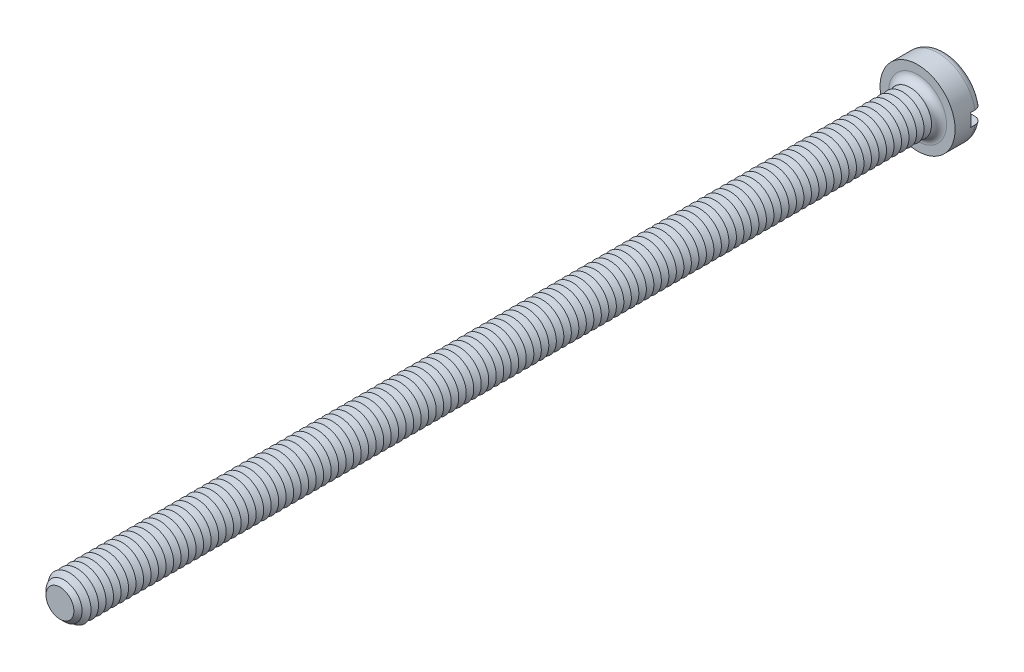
from build123d import *

# Parameters (mm, degrees)
SKETCH3_R           = 3.5
BOSS_EXTRUDE2_DEPTH = 2.6
SKETCH4_R           = 2
BOSS_EXTRUDE3_DEPTH = 80
FILLET1_R           = 0.7
CHAMFER1_SIZE       = 0.7
LPATTERN1_COUNT     = 113
LPATTERN1_PITCH     = 0.7
SKETCH8_W           = 7
SKETCH8_H           = 1.2
CUT_EXTRUDE1_DEPTH  = 1.1


with BuildPart() as part:
    # Sketch3 → Boss-Extrude2 (new body)
    with BuildSketch(Plane.XY):
        Circle(SKETCH3_R)
    extrude(amount=-BOSS_EXTRUDE2_DEPTH)

    # Sketch4 → Boss-Extrude3 (add)
    with BuildSketch(Plane.XY):
        Circle(SKETCH4_R)
    extrude(amount=BOSS_EXTRUDE3_DEPTH)

    # Fillet1
    fillet1_edges = [part.edges().sort_by_distance(p)[0] for p in [
        (-3.5, 0, -2.6),
        (-2, 0, 0),
    ]]
    fillet(fillet1_edges, radius=FILLET1_R)

    # Chamfer1
    chamfer1_edges = [part.edges().sort_by_distance(p)[0] for p in [
        (-2, 0, 80),
    ]]
    chamfer(chamfer1_edges, length=CHAMFER1_SIZE)

    # Sketch6 → Cut-Revolve1 (revolve, cut)
    with BuildSketch(Plane(origin=(0, 0, 0), x_dir=(0, 0, -1), z_dir=(1, 0, 0)), mode=Mode.PRIVATE) as cut_revolve1_sk:
        Polygon((-0.7, 2), (-1.05, 1.393782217), (-1.4, 2), align=None)
    cut_revolve1 = revolve(cut_revolve1_sk.sketch.rotate(Axis((0, 0, -1.694361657), (0, 0, 1)), 90), axis=Axis((0, 0, -1.694361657), (0, 0, 1)), mode=Mode.SUBTRACT)

    # LPattern1: Cut-Revolve1 ×113
    with Locations(*[(0, 0, i * LPATTERN1_PITCH) for i in range(1, LPATTERN1_COUNT)]):
        add(cut_revolve1, mode=Mode.SUBTRACT)

    # Sketch8 → Cut-Extrude1 (cut)
    with BuildSketch(Plane(origin=(0, 0, -2.6), x_dir=(-1, 0, 0), z_dir=(0, 0, -1))):
        Rectangle(SKETCH8_W, SKETCH8_H)
    extrude(amount=-CUT_EXTRUDE1_DEPTH, mode=Mode.SUBTRACT)


solid = part.part
